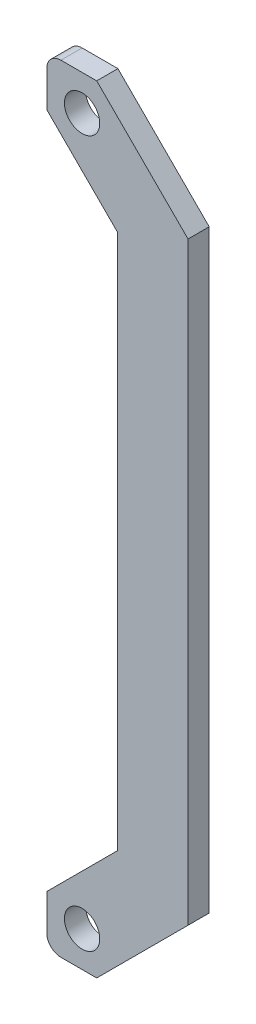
ISO-10303-21;
HEADER;
FILE_DESCRIPTION(('STEP AP214'),'2;1');
FILE_NAME('part.step','',(''),(''),'','','');
FILE_SCHEMA(('AUTOMOTIVE_DESIGN { 1 0 10303 214 1 1 1 1 }'));
ENDSEC;
DATA;
#1=APPLICATION_CONTEXT('core data for automotive mechanical design processes');
#2=APPLICATION_PROTOCOL_DEFINITION('international standard','automotive_design',2000,#1);
#3=PRODUCT_CONTEXT('',#1,'mechanical');
#4=PRODUCT('Part','Part','',(#3));
#5=PRODUCT_RELATED_PRODUCT_CATEGORY('part','',(#4));
#6=PRODUCT_DEFINITION_FORMATION('','',#4);
#7=PRODUCT_DEFINITION_CONTEXT('part definition',#1,'design');
#8=PRODUCT_DEFINITION('design','',#6,#7);
#9=PRODUCT_DEFINITION_SHAPE('','',#8);
#10=(LENGTH_UNIT() NAMED_UNIT(*) SI_UNIT(.MILLI.,.METRE.));
#11=(NAMED_UNIT(*) PLANE_ANGLE_UNIT() SI_UNIT($,.RADIAN.));
#12=(NAMED_UNIT(*) SI_UNIT($,.STERADIAN.) SOLID_ANGLE_UNIT());
#13=UNCERTAINTY_MEASURE_WITH_UNIT(LENGTH_MEASURE(1.E-05),#10,'distance_accuracy_value','');
#14=(GEOMETRIC_REPRESENTATION_CONTEXT(3) GLOBAL_UNCERTAINTY_ASSIGNED_CONTEXT((#13)) GLOBAL_UNIT_ASSIGNED_CONTEXT((#10,
#11,#12)) REPRESENTATION_CONTEXT('',''));
#15=CARTESIAN_POINT('',(0.,0.,0.));
#16=DIRECTION('',(0.,0.,1.));
#17=DIRECTION('',(1.,0.,0.));
#18=AXIS2_PLACEMENT_3D('',#15,#16,#17);
#19=CARTESIAN_POINT('',(0.,0.,1.5));
#20=DIRECTION('',(0.,0.,-1.));
#21=DIRECTION('',(-1.,0.,0.));
#22=AXIS2_PLACEMENT_3D('',#19,#20,#21);
#23=PLANE('',#22);
#24=DIRECTION('',(-1.,0.,0.));
#25=VECTOR('',#24,1.);
#26=CARTESIAN_POINT('',(-15.,55.,1.5));
#27=LINE('',#26,#25);
#28=CARTESIAN_POINT('',(-7.92893218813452,55.,1.5));
#29=VERTEX_POINT('',#28);
#30=CARTESIAN_POINT('',(-13.,55.,1.5));
#31=VERTEX_POINT('',#30);
#32=EDGE_CURVE('E223',#29,#31,#27,.T.);
#33=ORIENTED_EDGE('',*,*,#32,.T.);
#34=CARTESIAN_POINT('',(-13.,53.,1.5));
#35=DIRECTION('',(0.,0.,-1.));
#36=DIRECTION('',(-1.,0.,0.));
#37=AXIS2_PLACEMENT_3D('',#34,#35,#36);
#38=CIRCLE('',#37,2.);
#39=CARTESIAN_POINT('',(-15.,53.,1.5));
#40=VERTEX_POINT('',#39);
#41=EDGE_CURVE('E165',#31,#40,#38,.F.);
#42=ORIENTED_EDGE('',*,*,#41,.T.);
#43=DIRECTION('',(0.,-1.,0.));
#44=VECTOR('',#43,1.);
#45=CARTESIAN_POINT('',(-15.,47.9289321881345,1.5));
#46=LINE('',#45,#44);
#47=CARTESIAN_POINT('',(-15.,47.9289321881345,1.5));
#48=VERTEX_POINT('',#47);
#49=EDGE_CURVE('E141',#40,#48,#46,.T.);
#50=ORIENTED_EDGE('',*,*,#49,.T.);
#51=DIRECTION('',(0.707106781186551,-0.707106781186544,0.));
#52=VECTOR('',#51,1.);
#53=CARTESIAN_POINT('',(-4.99999999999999,37.9289321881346,1.5));
#54=LINE('',#53,#52);
#55=CARTESIAN_POINT('',(-4.99999999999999,37.9289321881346,1.5));
#56=VERTEX_POINT('',#55);
#57=EDGE_CURVE('E135',#48,#56,#54,.T.);
#58=ORIENTED_EDGE('',*,*,#57,.T.);
#59=DIRECTION('',(0.,-1.,0.));
#60=VECTOR('',#59,1.);
#61=CARTESIAN_POINT('',(-4.99999999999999,37.9289321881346,1.5));
#62=LINE('',#61,#60);
#63=CARTESIAN_POINT('',(-4.99999999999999,-37.9289321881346,1.5));
#64=VERTEX_POINT('',#63);
#65=EDGE_CURVE('E125',#56,#64,#62,.T.);
#66=ORIENTED_EDGE('',*,*,#65,.T.);
#67=DIRECTION('',(-0.707106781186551,-0.707106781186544,0.));
#68=VECTOR('',#67,1.);
#69=CARTESIAN_POINT('',(-4.99999999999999,-37.9289321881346,1.5));
#70=LINE('',#69,#68);
#71=CARTESIAN_POINT('',(-15.,-47.9289321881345,1.5));
#72=VERTEX_POINT('',#71);
#73=EDGE_CURVE('E134',#64,#72,#70,.T.);
#74=ORIENTED_EDGE('',*,*,#73,.T.);
#75=DIRECTION('',(0.,-1.,0.));
#76=VECTOR('',#75,1.);
#77=CARTESIAN_POINT('',(-15.,-47.9289321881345,1.5));
#78=LINE('',#77,#76);
#79=CARTESIAN_POINT('',(-15.,-53.,1.5));
#80=VERTEX_POINT('',#79);
#81=EDGE_CURVE('E214',#72,#80,#78,.T.);
#82=ORIENTED_EDGE('',*,*,#81,.T.);
#83=CARTESIAN_POINT('',(-13.,-53.,1.5));
#84=DIRECTION('',(0.,0.,-1.));
#85=DIRECTION('',(-1.,0.,0.));
#86=AXIS2_PLACEMENT_3D('',#83,#84,#85);
#87=CIRCLE('',#86,2.);
#88=CARTESIAN_POINT('',(-13.,-55.,1.5));
#89=VERTEX_POINT('',#88);
#90=EDGE_CURVE('E51',#80,#89,#87,.F.);
#91=ORIENTED_EDGE('',*,*,#90,.T.);
#92=DIRECTION('',(1.,0.,0.));
#93=VECTOR('',#92,1.);
#94=CARTESIAN_POINT('',(-15.,-55.,1.5));
#95=LINE('',#94,#93);
#96=CARTESIAN_POINT('',(-7.92893218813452,-55.,1.5));
#97=VERTEX_POINT('',#96);
#98=EDGE_CURVE('E174',#89,#97,#95,.T.);
#99=ORIENTED_EDGE('',*,*,#98,.T.);
#100=DIRECTION('',(0.707106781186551,0.707106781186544,0.));
#101=VECTOR('',#100,1.);
#102=CARTESIAN_POINT('',(-7.92893218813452,-55.,1.5));
#103=LINE('',#102,#101);
#104=CARTESIAN_POINT('',(5.00000000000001,-42.0710678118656,1.5));
#105=VERTEX_POINT('',#104);
#106=EDGE_CURVE('E229',#97,#105,#103,.T.);
#107=ORIENTED_EDGE('',*,*,#106,.T.);
#108=DIRECTION('',(0.,1.,0.));
#109=VECTOR('',#108,1.);
#110=CARTESIAN_POINT('',(5.00000000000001,42.0710678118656,1.5));
#111=LINE('',#110,#109);
#112=CARTESIAN_POINT('',(5.00000000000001,42.0710678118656,1.5));
#113=VERTEX_POINT('',#112);
#114=EDGE_CURVE('E227',#105,#113,#111,.T.);
#115=ORIENTED_EDGE('',*,*,#114,.T.);
#116=DIRECTION('',(-0.707106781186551,0.707106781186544,0.));
#117=VECTOR('',#116,1.);
#118=CARTESIAN_POINT('',(-7.92893218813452,55.,1.5));
#119=LINE('',#118,#117);
#120=EDGE_CURVE('E225',#113,#29,#119,.T.);
#121=ORIENTED_EDGE('',*,*,#120,.T.);
#122=EDGE_LOOP('',(#33,#42,#50,#58,#66,#74,#82,#91,#99,#107,#115,#121));
#123=FACE_BOUND('',#122,.T.);
#124=CARTESIAN_POINT('',(-9.99999999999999,-50.,1.5));
#125=DIRECTION('',(0.,0.,1.));
#126=DIRECTION('',(-1.,0.,0.));
#127=AXIS2_PLACEMENT_3D('',#124,#125,#126);
#128=CIRCLE('',#127,2.5);
#129=CARTESIAN_POINT('',(-12.5,-50.,1.5));
#130=VERTEX_POINT('',#129);
#131=EDGE_CURVE('E221',#130,#130,#128,.T.);
#132=ORIENTED_EDGE('',*,*,#131,.F.);
#133=EDGE_LOOP('',(#132));
#134=FACE_BOUND('',#133,.T.);
#135=CARTESIAN_POINT('',(-9.99999999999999,50.,1.5));
#136=DIRECTION('',(0.,0.,1.));
#137=DIRECTION('',(1.,0.,0.));
#138=AXIS2_PLACEMENT_3D('',#135,#136,#137);
#139=CIRCLE('',#138,2.5);
#140=CARTESIAN_POINT('',(-7.49999999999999,50.,1.5));
#141=VERTEX_POINT('',#140);
#142=EDGE_CURVE('E237',#141,#141,#139,.T.);
#143=ORIENTED_EDGE('',*,*,#142,.F.);
#144=EDGE_LOOP('',(#143));
#145=FACE_BOUND('',#144,.T.);
#146=ADVANCED_FACE('F36',(#123,#134,#145),#23,.F.);
#147=CARTESIAN_POINT('',(0.,0.,-1.5));
#148=DIRECTION('',(0.,0.,-1.));
#149=DIRECTION('',(-1.,0.,0.));
#150=AXIS2_PLACEMENT_3D('',#147,#148,#149);
#151=PLANE('',#150);
#152=CARTESIAN_POINT('',(-9.99999999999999,-50.,-1.5));
#153=DIRECTION('',(0.,0.,1.));
#154=DIRECTION('',(-1.,0.,0.));
#155=AXIS2_PLACEMENT_3D('',#152,#153,#154);
#156=CIRCLE('',#155,2.5);
#157=CARTESIAN_POINT('',(-12.5,-50.,-1.5));
#158=VERTEX_POINT('',#157);
#159=EDGE_CURVE('E234',#158,#158,#156,.T.);
#160=ORIENTED_EDGE('',*,*,#159,.T.);
#161=EDGE_LOOP('',(#160));
#162=FACE_BOUND('',#161,.T.);
#163=DIRECTION('',(0.,-1.,0.));
#164=VECTOR('',#163,1.);
#165=CARTESIAN_POINT('',(-15.,47.9289321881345,-1.5));
#166=LINE('',#165,#164);
#167=CARTESIAN_POINT('',(-15.,53.,-1.5));
#168=VERTEX_POINT('',#167);
#169=CARTESIAN_POINT('',(-15.,47.9289321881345,-1.5));
#170=VERTEX_POINT('',#169);
#171=EDGE_CURVE('E145',#168,#170,#166,.T.);
#172=ORIENTED_EDGE('',*,*,#171,.F.);
#173=CARTESIAN_POINT('',(-13.,53.,-1.5));
#174=DIRECTION('',(0.,0.,-1.));
#175=DIRECTION('',(-1.,0.,0.));
#176=AXIS2_PLACEMENT_3D('',#173,#174,#175);
#177=CIRCLE('',#176,2.);
#178=CARTESIAN_POINT('',(-13.,55.,-1.5));
#179=VERTEX_POINT('',#178);
#180=EDGE_CURVE('E160',#168,#179,#177,.T.);
#181=ORIENTED_EDGE('',*,*,#180,.T.);
#182=DIRECTION('',(-1.,0.,0.));
#183=VECTOR('',#182,1.);
#184=CARTESIAN_POINT('',(-15.,55.,-1.5));
#185=LINE('',#184,#183);
#186=CARTESIAN_POINT('',(-7.92893218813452,55.,-1.5));
#187=VERTEX_POINT('',#186);
#188=EDGE_CURVE('E195',#187,#179,#185,.T.);
#189=ORIENTED_EDGE('',*,*,#188,.F.);
#190=DIRECTION('',(-0.707106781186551,0.707106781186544,0.));
#191=VECTOR('',#190,1.);
#192=CARTESIAN_POINT('',(-7.92893218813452,55.,-1.5));
#193=LINE('',#192,#191);
#194=CARTESIAN_POINT('',(5.00000000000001,42.0710678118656,-1.5));
#195=VERTEX_POINT('',#194);
#196=EDGE_CURVE('E193',#195,#187,#193,.T.);
#197=ORIENTED_EDGE('',*,*,#196,.F.);
#198=DIRECTION('',(0.,1.,0.));
#199=VECTOR('',#198,1.);
#200=CARTESIAN_POINT('',(5.00000000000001,42.0710678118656,-1.5));
#201=LINE('',#200,#199);
#202=CARTESIAN_POINT('',(5.00000000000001,-42.0710678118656,-1.5));
#203=VERTEX_POINT('',#202);
#204=EDGE_CURVE('E186',#203,#195,#201,.T.);
#205=ORIENTED_EDGE('',*,*,#204,.F.);
#206=DIRECTION('',(0.707106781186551,0.707106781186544,0.));
#207=VECTOR('',#206,1.);
#208=CARTESIAN_POINT('',(-7.92893218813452,-55.,-1.5));
#209=LINE('',#208,#207);
#210=CARTESIAN_POINT('',(-7.92893218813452,-55.,-1.5));
#211=VERTEX_POINT('',#210);
#212=EDGE_CURVE('E183',#211,#203,#209,.T.);
#213=ORIENTED_EDGE('',*,*,#212,.F.);
#214=DIRECTION('',(1.,0.,0.));
#215=VECTOR('',#214,1.);
#216=CARTESIAN_POINT('',(-15.,-55.,-1.5));
#217=LINE('',#216,#215);
#218=CARTESIAN_POINT('',(-13.,-55.,-1.5));
#219=VERTEX_POINT('',#218);
#220=EDGE_CURVE('E172',#219,#211,#217,.T.);
#221=ORIENTED_EDGE('',*,*,#220,.F.);
#222=CARTESIAN_POINT('',(-13.,-53.,-1.5));
#223=DIRECTION('',(0.,0.,-1.));
#224=DIRECTION('',(-1.,0.,0.));
#225=AXIS2_PLACEMENT_3D('',#222,#223,#224);
#226=CIRCLE('',#225,2.);
#227=CARTESIAN_POINT('',(-15.,-53.,-1.5));
#228=VERTEX_POINT('',#227);
#229=EDGE_CURVE('E153',#219,#228,#226,.T.);
#230=ORIENTED_EDGE('',*,*,#229,.T.);
#231=DIRECTION('',(0.,-1.,0.));
#232=VECTOR('',#231,1.);
#233=CARTESIAN_POINT('',(-15.,-47.9289321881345,-1.5));
#234=LINE('',#233,#232);
#235=CARTESIAN_POINT('',(-15.,-47.9289321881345,-1.5));
#236=VERTEX_POINT('',#235);
#237=EDGE_CURVE('E184',#236,#228,#234,.T.);
#238=ORIENTED_EDGE('',*,*,#237,.F.);
#239=DIRECTION('',(-0.707106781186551,-0.707106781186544,0.));
#240=VECTOR('',#239,1.);
#241=CARTESIAN_POINT('',(-4.99999999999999,-37.9289321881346,-1.5));
#242=LINE('',#241,#240);
#243=CARTESIAN_POINT('',(-4.99999999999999,-37.9289321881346,-1.5));
#244=VERTEX_POINT('',#243);
#245=EDGE_CURVE('E188',#244,#236,#242,.T.);
#246=ORIENTED_EDGE('',*,*,#245,.F.);
#247=DIRECTION('',(0.,-1.,0.));
#248=VECTOR('',#247,1.);
#249=CARTESIAN_POINT('',(-4.99999999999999,37.9289321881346,-1.5));
#250=LINE('',#249,#248);
#251=CARTESIAN_POINT('',(-4.99999999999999,37.9289321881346,-1.5));
#252=VERTEX_POINT('',#251);
#253=EDGE_CURVE('E217',#252,#244,#250,.T.);
#254=ORIENTED_EDGE('',*,*,#253,.F.);
#255=DIRECTION('',(0.707106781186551,-0.707106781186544,0.));
#256=VECTOR('',#255,1.);
#257=CARTESIAN_POINT('',(-4.99999999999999,37.9289321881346,-1.5));
#258=LINE('',#257,#256);
#259=EDGE_CURVE('E149',#170,#252,#258,.T.);
#260=ORIENTED_EDGE('',*,*,#259,.F.);
#261=EDGE_LOOP('',(#172,#181,#189,#197,#205,#213,#221,#230,#238,#246,#254,#260));
#262=FACE_BOUND('',#261,.T.);
#263=CARTESIAN_POINT('',(-9.99999999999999,50.,-1.5));
#264=DIRECTION('',(0.,0.,1.));
#265=DIRECTION('',(1.,0.,0.));
#266=AXIS2_PLACEMENT_3D('',#263,#264,#265);
#267=CIRCLE('',#266,2.5);
#268=CARTESIAN_POINT('',(-7.49999999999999,50.,-1.5));
#269=VERTEX_POINT('',#268);
#270=EDGE_CURVE('E240',#269,#269,#267,.T.);
#271=ORIENTED_EDGE('',*,*,#270,.T.);
#272=EDGE_LOOP('',(#271));
#273=FACE_BOUND('',#272,.T.);
#274=ADVANCED_FACE('F179',(#162,#262,#273),#151,.T.);
#275=CARTESIAN_POINT('',(-4.99999999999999,37.9289321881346,1.5));
#276=DIRECTION('',(0.707106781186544,0.707106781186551,0.));
#277=DIRECTION('',(-0.707106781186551,0.707106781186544,0.));
#278=AXIS2_PLACEMENT_3D('',#275,#276,#277);
#279=PLANE('',#278);
#280=ORIENTED_EDGE('',*,*,#259,.T.);
#281=DIRECTION('',(0.,0.,-1.));
#282=VECTOR('',#281,1.);
#283=CARTESIAN_POINT('',(-4.99999999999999,37.9289321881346,1.5));
#284=LINE('',#283,#282);
#285=EDGE_CURVE('E129',#56,#252,#284,.T.);
#286=ORIENTED_EDGE('',*,*,#285,.F.);
#287=ORIENTED_EDGE('',*,*,#57,.F.);
#288=DIRECTION('',(0.,0.,-1.));
#289=VECTOR('',#288,1.);
#290=CARTESIAN_POINT('',(-15.,47.9289321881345,1.5));
#291=LINE('',#290,#289);
#292=EDGE_CURVE('E199',#48,#170,#291,.T.);
#293=ORIENTED_EDGE('',*,*,#292,.T.);
#294=EDGE_LOOP('',(#280,#286,#287,#293));
#295=FACE_BOUND('',#294,.T.);
#296=ADVANCED_FACE('F147',(#295),#279,.F.);
#297=CARTESIAN_POINT('',(-4.99999999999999,37.9289321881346,1.5));
#298=DIRECTION('',(1.,0.,0.));
#299=DIRECTION('',(0.,0.,-1.));
#300=AXIS2_PLACEMENT_3D('',#297,#298,#299);
#301=PLANE('',#300);
#302=ORIENTED_EDGE('',*,*,#253,.T.);
#303=DIRECTION('',(0.,0.,-1.));
#304=VECTOR('',#303,1.);
#305=CARTESIAN_POINT('',(-4.99999999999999,-37.9289321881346,1.5));
#306=LINE('',#305,#304);
#307=EDGE_CURVE('E132',#64,#244,#306,.T.);
#308=ORIENTED_EDGE('',*,*,#307,.F.);
#309=ORIENTED_EDGE('',*,*,#65,.F.);
#310=ORIENTED_EDGE('',*,*,#285,.T.);
#311=EDGE_LOOP('',(#302,#308,#309,#310));
#312=FACE_BOUND('',#311,.T.);
#313=ADVANCED_FACE('F127',(#312),#301,.F.);
#314=CARTESIAN_POINT('',(-4.99999999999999,-37.9289321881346,1.5));
#315=DIRECTION('',(0.707106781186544,-0.707106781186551,0.));
#316=DIRECTION('',(0.707106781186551,0.707106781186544,0.));
#317=AXIS2_PLACEMENT_3D('',#314,#315,#316);
#318=PLANE('',#317);
#319=ORIENTED_EDGE('',*,*,#245,.T.);
#320=DIRECTION('',(0.,0.,-1.));
#321=VECTOR('',#320,1.);
#322=CARTESIAN_POINT('',(-15.,-47.9289321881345,1.5));
#323=LINE('',#322,#321);
#324=EDGE_CURVE('E155',#72,#236,#323,.T.);
#325=ORIENTED_EDGE('',*,*,#324,.F.);
#326=ORIENTED_EDGE('',*,*,#73,.F.);
#327=ORIENTED_EDGE('',*,*,#307,.T.);
#328=EDGE_LOOP('',(#319,#325,#326,#327));
#329=FACE_BOUND('',#328,.T.);
#330=ADVANCED_FACE('F284',(#329),#318,.F.);
#331=CARTESIAN_POINT('',(-15.,-47.9289321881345,1.5));
#332=DIRECTION('',(1.,0.,0.));
#333=DIRECTION('',(0.,0.,-1.));
#334=AXIS2_PLACEMENT_3D('',#331,#332,#333);
#335=PLANE('',#334);
#336=ORIENTED_EDGE('',*,*,#237,.T.);
#337=DIRECTION('',(0.,0.,-1.));
#338=VECTOR('',#337,1.);
#339=CARTESIAN_POINT('',(-15.,-53.,1.5));
#340=LINE('',#339,#338);
#341=EDGE_CURVE('E11',#228,#80,#340,.F.);
#342=ORIENTED_EDGE('',*,*,#341,.T.);
#343=ORIENTED_EDGE('',*,*,#81,.F.);
#344=ORIENTED_EDGE('',*,*,#324,.T.);
#345=EDGE_LOOP('',(#336,#342,#343,#344));
#346=FACE_BOUND('',#345,.T.);
#347=ADVANCED_FACE('F213',(#346),#335,.F.);
#348=CARTESIAN_POINT('',(-15.,-55.,1.5));
#349=DIRECTION('',(0.,1.,0.));
#350=DIRECTION('',(0.,0.,1.));
#351=AXIS2_PLACEMENT_3D('',#348,#349,#350);
#352=PLANE('',#351);
#353=ORIENTED_EDGE('',*,*,#98,.F.);
#354=DIRECTION('',(0.,0.,-1.));
#355=VECTOR('',#354,1.);
#356=CARTESIAN_POINT('',(-13.,-55.,1.5));
#357=LINE('',#356,#355);
#358=EDGE_CURVE('E44',#89,#219,#357,.T.);
#359=ORIENTED_EDGE('',*,*,#358,.T.);
#360=ORIENTED_EDGE('',*,*,#220,.T.);
#361=DIRECTION('',(0.,0.,-1.));
#362=VECTOR('',#361,1.);
#363=CARTESIAN_POINT('',(-7.92893218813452,-55.,1.5));
#364=LINE('',#363,#362);
#365=EDGE_CURVE('E210',#97,#211,#364,.T.);
#366=ORIENTED_EDGE('',*,*,#365,.F.);
#367=EDGE_LOOP('',(#353,#359,#360,#366));
#368=FACE_BOUND('',#367,.T.);
#369=ADVANCED_FACE('F170',(#368),#352,.F.);
#370=CARTESIAN_POINT('',(-7.92893218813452,-55.,1.5));
#371=DIRECTION('',(-0.707106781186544,0.707106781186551,0.));
#372=DIRECTION('',(-0.707106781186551,-0.707106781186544,0.));
#373=AXIS2_PLACEMENT_3D('',#370,#371,#372);
#374=PLANE('',#373);
#375=ORIENTED_EDGE('',*,*,#212,.T.);
#376=DIRECTION('',(0.,0.,-1.));
#377=VECTOR('',#376,1.);
#378=CARTESIAN_POINT('',(5.00000000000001,-42.0710678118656,1.5));
#379=LINE('',#378,#377);
#380=EDGE_CURVE('E207',#105,#203,#379,.T.);
#381=ORIENTED_EDGE('',*,*,#380,.F.);
#382=ORIENTED_EDGE('',*,*,#106,.F.);
#383=ORIENTED_EDGE('',*,*,#365,.T.);
#384=EDGE_LOOP('',(#375,#381,#382,#383));
#385=FACE_BOUND('',#384,.T.);
#386=ADVANCED_FACE('F275',(#385),#374,.F.);
#387=CARTESIAN_POINT('',(5.00000000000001,42.0710678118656,1.5));
#388=DIRECTION('',(-1.,0.,0.));
#389=DIRECTION('',(0.,0.,1.));
#390=AXIS2_PLACEMENT_3D('',#387,#388,#389);
#391=PLANE('',#390);
#392=ORIENTED_EDGE('',*,*,#204,.T.);
#393=DIRECTION('',(0.,0.,-1.));
#394=VECTOR('',#393,1.);
#395=CARTESIAN_POINT('',(5.00000000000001,42.0710678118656,1.5));
#396=LINE('',#395,#394);
#397=EDGE_CURVE('E204',#113,#195,#396,.T.);
#398=ORIENTED_EDGE('',*,*,#397,.F.);
#399=ORIENTED_EDGE('',*,*,#114,.F.);
#400=ORIENTED_EDGE('',*,*,#380,.T.);
#401=EDGE_LOOP('',(#392,#398,#399,#400));
#402=FACE_BOUND('',#401,.T.);
#403=ADVANCED_FACE('F271',(#402),#391,.F.);
#404=CARTESIAN_POINT('',(-7.92893218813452,55.,1.5));
#405=DIRECTION('',(-0.707106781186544,-0.707106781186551,0.));
#406=DIRECTION('',(0.707106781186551,-0.707106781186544,0.));
#407=AXIS2_PLACEMENT_3D('',#404,#405,#406);
#408=PLANE('',#407);
#409=ORIENTED_EDGE('',*,*,#196,.T.);
#410=DIRECTION('',(0.,0.,-1.));
#411=VECTOR('',#410,1.);
#412=CARTESIAN_POINT('',(-7.92893218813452,55.,1.5));
#413=LINE('',#412,#411);
#414=EDGE_CURVE('E201',#29,#187,#413,.T.);
#415=ORIENTED_EDGE('',*,*,#414,.F.);
#416=ORIENTED_EDGE('',*,*,#120,.F.);
#417=ORIENTED_EDGE('',*,*,#397,.T.);
#418=EDGE_LOOP('',(#409,#415,#416,#417));
#419=FACE_BOUND('',#418,.T.);
#420=ADVANCED_FACE('F267',(#419),#408,.F.);
#421=CARTESIAN_POINT('',(-15.,55.,1.5));
#422=DIRECTION('',(0.,-1.,0.));
#423=DIRECTION('',(0.,0.,-1.));
#424=AXIS2_PLACEMENT_3D('',#421,#422,#423);
#425=PLANE('',#424);
#426=ORIENTED_EDGE('',*,*,#188,.T.);
#427=DIRECTION('',(0.,0.,-1.));
#428=VECTOR('',#427,1.);
#429=CARTESIAN_POINT('',(-13.,55.,1.5));
#430=LINE('',#429,#428);
#431=EDGE_CURVE('E162',#179,#31,#430,.F.);
#432=ORIENTED_EDGE('',*,*,#431,.T.);
#433=ORIENTED_EDGE('',*,*,#32,.F.);
#434=ORIENTED_EDGE('',*,*,#414,.T.);
#435=EDGE_LOOP('',(#426,#432,#433,#434));
#436=FACE_BOUND('',#435,.T.);
#437=ADVANCED_FACE('F263',(#436),#425,.F.);
#438=CARTESIAN_POINT('',(-15.,47.9289321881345,1.5));
#439=DIRECTION('',(1.,0.,0.));
#440=DIRECTION('',(0.,0.,-1.));
#441=AXIS2_PLACEMENT_3D('',#438,#439,#440);
#442=PLANE('',#441);
#443=ORIENTED_EDGE('',*,*,#49,.F.);
#444=DIRECTION('',(0.,0.,-1.));
#445=VECTOR('',#444,1.);
#446=CARTESIAN_POINT('',(-15.,53.,1.5));
#447=LINE('',#446,#445);
#448=EDGE_CURVE('E150',#40,#168,#447,.T.);
#449=ORIENTED_EDGE('',*,*,#448,.T.);
#450=ORIENTED_EDGE('',*,*,#171,.T.);
#451=ORIENTED_EDGE('',*,*,#292,.F.);
#452=EDGE_LOOP('',(#443,#449,#450,#451));
#453=FACE_BOUND('',#452,.T.);
#454=ADVANCED_FACE('F260',(#453),#442,.F.);
#455=CARTESIAN_POINT('',(-9.99999999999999,-50.,1.5));
#456=DIRECTION('',(0.,0.,-1.));
#457=DIRECTION('',(-1.,0.,0.));
#458=AXIS2_PLACEMENT_3D('',#455,#456,#457);
#459=CYLINDRICAL_SURFACE('',#458,2.5);
#460=ORIENTED_EDGE('',*,*,#131,.T.);
#461=EDGE_LOOP('',(#460));
#462=FACE_BOUND('',#461,.T.);
#463=ORIENTED_EDGE('',*,*,#159,.F.);
#464=EDGE_LOOP('',(#463));
#465=FACE_BOUND('',#464,.T.);
#466=ADVANCED_FACE('F257',(#462,#465),#459,.F.);
#467=CARTESIAN_POINT('',(-9.99999999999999,50.,1.5));
#468=DIRECTION('',(0.,0.,-1.));
#469=DIRECTION('',(-1.,0.,0.));
#470=AXIS2_PLACEMENT_3D('',#467,#468,#469);
#471=CYLINDRICAL_SURFACE('',#470,2.5);
#472=ORIENTED_EDGE('',*,*,#142,.T.);
#473=EDGE_LOOP('',(#472));
#474=FACE_BOUND('',#473,.T.);
#475=ORIENTED_EDGE('',*,*,#270,.F.);
#476=EDGE_LOOP('',(#475));
#477=FACE_BOUND('',#476,.T.);
#478=ADVANCED_FACE('F246',(#474,#477),#471,.F.);
#479=CARTESIAN_POINT('',(-13.,53.,1.5));
#480=DIRECTION('',(0.,0.,-1.));
#481=DIRECTION('',(-1.,0.,0.));
#482=AXIS2_PLACEMENT_3D('',#479,#480,#481);
#483=CYLINDRICAL_SURFACE('',#482,2.);
#484=ORIENTED_EDGE('',*,*,#41,.F.);
#485=ORIENTED_EDGE('',*,*,#431,.F.);
#486=ORIENTED_EDGE('',*,*,#180,.F.);
#487=ORIENTED_EDGE('',*,*,#448,.F.);
#488=EDGE_LOOP('',(#484,#485,#486,#487));
#489=FACE_BOUND('',#488,.T.);
#490=ADVANCED_FACE('F290',(#489),#483,.T.);
#491=CARTESIAN_POINT('',(-13.,-53.,1.5));
#492=DIRECTION('',(0.,0.,-1.));
#493=DIRECTION('',(-1.,0.,0.));
#494=AXIS2_PLACEMENT_3D('',#491,#492,#493);
#495=CYLINDRICAL_SURFACE('',#494,2.);
#496=ORIENTED_EDGE('',*,*,#90,.F.);
#497=ORIENTED_EDGE('',*,*,#341,.F.);
#498=ORIENTED_EDGE('',*,*,#229,.F.);
#499=ORIENTED_EDGE('',*,*,#358,.F.);
#500=EDGE_LOOP('',(#496,#497,#498,#499));
#501=FACE_BOUND('',#500,.T.);
#502=ADVANCED_FACE('F38',(#501),#495,.T.);
#503=CLOSED_SHELL('',(#146,#274,#296,#313,#330,#347,#369,#386,#403,#420,#437,#454,#466,#478,
#490,#502));
#504=MANIFOLD_SOLID_BREP('B2',#503);
#505=ADVANCED_BREP_SHAPE_REPRESENTATION('',(#18,#504),#14);
#506=SHAPE_DEFINITION_REPRESENTATION(#9,#505);
ENDSEC;
END-ISO-10303-21;
